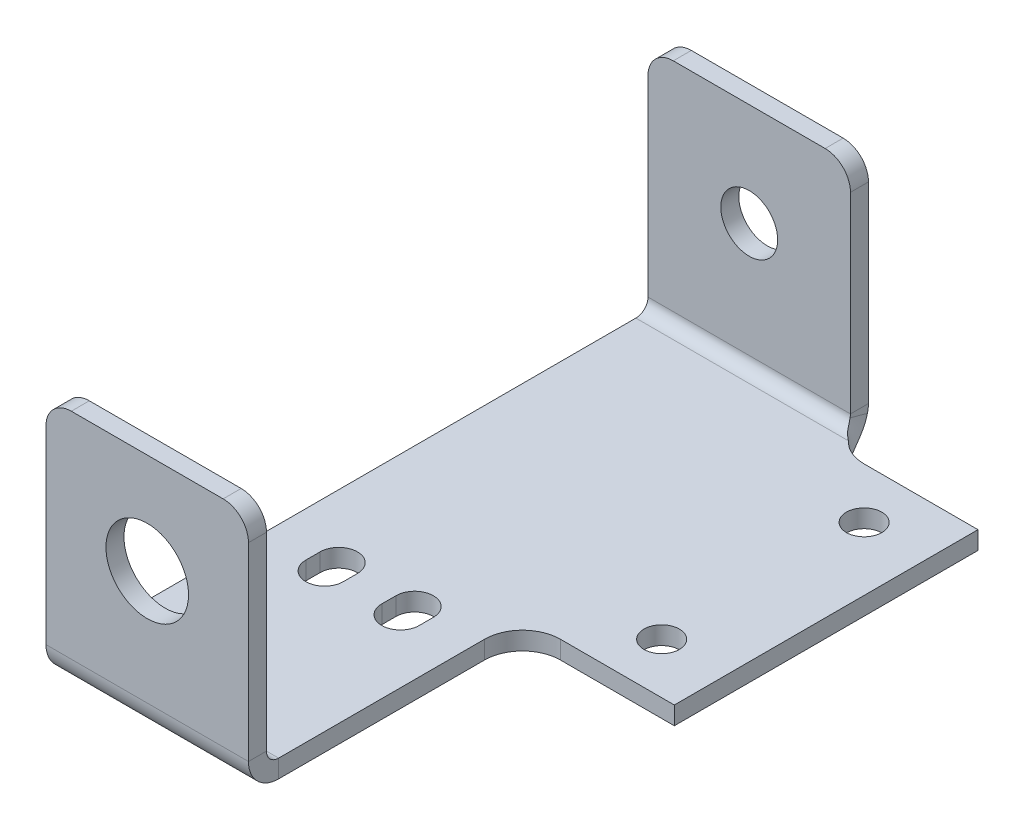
ISO-10303-21;
HEADER;
FILE_DESCRIPTION(('STEP AP214'),'2;1');
FILE_NAME('part.step','',(''),(''),'','','');
FILE_SCHEMA(('AUTOMOTIVE_DESIGN { 1 0 10303 214 1 1 1 1 }'));
ENDSEC;
DATA;
#1=APPLICATION_CONTEXT('core data for automotive mechanical design processes');
#2=APPLICATION_PROTOCOL_DEFINITION('international standard','automotive_design',2000,#1);
#3=PRODUCT_CONTEXT('',#1,'mechanical');
#4=PRODUCT('Part','Part','',(#3));
#5=PRODUCT_RELATED_PRODUCT_CATEGORY('part','',(#4));
#6=PRODUCT_DEFINITION_FORMATION('','',#4);
#7=PRODUCT_DEFINITION_CONTEXT('part definition',#1,'design');
#8=PRODUCT_DEFINITION('design','',#6,#7);
#9=PRODUCT_DEFINITION_SHAPE('','',#8);
#10=(LENGTH_UNIT() NAMED_UNIT(*) SI_UNIT(.MILLI.,.METRE.));
#11=(NAMED_UNIT(*) PLANE_ANGLE_UNIT() SI_UNIT($,.RADIAN.));
#12=(NAMED_UNIT(*) SI_UNIT($,.STERADIAN.) SOLID_ANGLE_UNIT());
#13=UNCERTAINTY_MEASURE_WITH_UNIT(LENGTH_MEASURE(1.E-05),#10,'distance_accuracy_value','');
#14=(GEOMETRIC_REPRESENTATION_CONTEXT(3) GLOBAL_UNCERTAINTY_ASSIGNED_CONTEXT((#13)) GLOBAL_UNIT_ASSIGNED_CONTEXT((#10,
#11,#12)) REPRESENTATION_CONTEXT('',''));
#15=CARTESIAN_POINT('',(0.,0.,0.));
#16=DIRECTION('',(0.,0.,1.));
#17=DIRECTION('',(1.,0.,0.));
#18=AXIS2_PLACEMENT_3D('',#15,#16,#17);
#19=CARTESIAN_POINT('',(-12.7,3.7846,36.63315));
#20=DIRECTION('',(-1.,0.,0.));
#21=DIRECTION('',(0.,0.,1.));
#22=AXIS2_PLACEMENT_3D('',#19,#20,#21);
#23=PLANE('',#22);
#24=DIRECTION('',(0.,0.,-1.));
#25=VECTOR('',#24,1.);
#26=CARTESIAN_POINT('',(-12.7,0.,38.89375));
#27=LINE('',#26,#25);
#28=CARTESIAN_POINT('',(-12.7,0.,35.10915));
#29=VERTEX_POINT('',#28);
#30=CARTESIAN_POINT('',(-12.7,0.,-35.10915));
#31=VERTEX_POINT('',#30);
#32=EDGE_CURVE('E586',#29,#31,#27,.T.);
#33=ORIENTED_EDGE('',*,*,#32,.F.);
#34=DIRECTION('',(0.,1.,0.));
#35=VECTOR('',#34,1.);
#36=CARTESIAN_POINT('',(-12.7,0.,35.10915));
#37=LINE('',#36,#35);
#38=CARTESIAN_POINT('',(-12.7,2.2606,35.10915));
#39=VERTEX_POINT('',#38);
#40=EDGE_CURVE('E608',#29,#39,#37,.T.);
#41=ORIENTED_EDGE('',*,*,#40,.T.);
#42=DIRECTION('',(0.,0.,-1.));
#43=VECTOR('',#42,1.);
#44=CARTESIAN_POINT('',(-12.7,2.2606,38.89375));
#45=LINE('',#44,#43);
#46=CARTESIAN_POINT('',(-12.7,2.26060000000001,-35.10915));
#47=VERTEX_POINT('',#46);
#48=EDGE_CURVE('E579',#39,#47,#45,.T.);
#49=ORIENTED_EDGE('',*,*,#48,.T.);
#50=DIRECTION('',(0.,-1.,0.));
#51=VECTOR('',#50,1.);
#52=CARTESIAN_POINT('',(-12.7,2.26060000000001,-35.10915));
#53=LINE('',#52,#51);
#54=EDGE_CURVE('E12',#47,#31,#53,.T.);
#55=ORIENTED_EDGE('',*,*,#54,.T.);
#56=EDGE_LOOP('',(#33,#41,#49,#55));
#57=FACE_BOUND('',#56,.T.);
#58=ADVANCED_FACE('F46',(#57),#23,.T.);
#59=CARTESIAN_POINT('',(12.7,3.78460000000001,-36.63315));
#60=DIRECTION('',(1.,0.,0.));
#61=DIRECTION('',(0.,0.,-1.));
#62=AXIS2_PLACEMENT_3D('',#59,#60,#61);
#63=PLANE('',#62);
#64=DIRECTION('',(0.,0.,-1.));
#65=VECTOR('',#64,1.);
#66=CARTESIAN_POINT('',(12.7,0.,38.89375));
#67=LINE('',#66,#65);
#68=CARTESIAN_POINT('',(12.7,0.,35.10915));
#69=VERTEX_POINT('',#68);
#70=CARTESIAN_POINT('',(12.7,0.,9.27735));
#71=VERTEX_POINT('',#70);
#72=EDGE_CURVE('E585',#69,#71,#67,.T.);
#73=ORIENTED_EDGE('',*,*,#72,.T.);
#74=DIRECTION('',(0.,1.,0.));
#75=VECTOR('',#74,1.);
#76=CARTESIAN_POINT('',(12.7,2.26060000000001,9.27735));
#77=LINE('',#76,#75);
#78=CARTESIAN_POINT('',(12.7,2.26060000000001,9.27735));
#79=VERTEX_POINT('',#78);
#80=EDGE_CURVE('E589',#71,#79,#77,.T.);
#81=ORIENTED_EDGE('',*,*,#80,.T.);
#82=DIRECTION('',(0.,0.,-1.));
#83=VECTOR('',#82,1.);
#84=CARTESIAN_POINT('',(12.7,2.2606,38.89375));
#85=LINE('',#84,#83);
#86=CARTESIAN_POINT('',(12.7,2.2606,35.10915));
#87=VERTEX_POINT('',#86);
#88=EDGE_CURVE('E582',#87,#79,#85,.T.);
#89=ORIENTED_EDGE('',*,*,#88,.F.);
#90=DIRECTION('',(0.,-1.,0.));
#91=VECTOR('',#90,1.);
#92=CARTESIAN_POINT('',(12.7,2.2606,35.10915));
#93=LINE('',#92,#91);
#94=EDGE_CURVE('E615',#87,#69,#93,.T.);
#95=ORIENTED_EDGE('',*,*,#94,.T.);
#96=EDGE_LOOP('',(#73,#81,#89,#95));
#97=FACE_BOUND('',#96,.T.);
#98=ADVANCED_FACE('F677',(#97),#63,.T.);
#99=CARTESIAN_POINT('',(12.7,2.2606,38.89375));
#100=DIRECTION('',(0.,1.,0.));
#101=DIRECTION('',(0.,0.,1.));
#102=AXIS2_PLACEMENT_3D('',#99,#100,#101);
#103=PLANE('',#102);
#104=CARTESIAN_POINT('',(4.7625,2.2606,11.88085));
#105=DIRECTION('',(0.,1.,0.));
#106=DIRECTION('',(0.,0.,1.));
#107=AXIS2_PLACEMENT_3D('',#104,#105,#106);
#108=CIRCLE('',#107,2.3495);
#109=CARTESIAN_POINT('',(2.413,2.2606,11.88085));
#110=VERTEX_POINT('',#109);
#111=CARTESIAN_POINT('',(7.112,2.2606,11.88085));
#112=VERTEX_POINT('',#111);
#113=EDGE_CURVE('E64',#110,#112,#108,.T.);
#114=ORIENTED_EDGE('',*,*,#113,.F.);
#115=DIRECTION('',(0.,0.,1.));
#116=VECTOR('',#115,1.);
#117=CARTESIAN_POINT('',(2.413,2.2606,11.88085));
#118=LINE('',#117,#116);
#119=CARTESIAN_POINT('',(2.413,2.26060000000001,10.10285));
#120=VERTEX_POINT('',#119);
#121=EDGE_CURVE('E264',#120,#110,#118,.T.);
#122=ORIENTED_EDGE('',*,*,#121,.F.);
#123=CARTESIAN_POINT('',(4.7625,2.26060000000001,10.10285));
#124=DIRECTION('',(0.,1.,0.));
#125=DIRECTION('',(0.,0.,1.));
#126=AXIS2_PLACEMENT_3D('',#123,#124,#125);
#127=CIRCLE('',#126,2.3495);
#128=CARTESIAN_POINT('',(7.112,2.26060000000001,10.10285));
#129=VERTEX_POINT('',#128);
#130=EDGE_CURVE('E267',#129,#120,#127,.T.);
#131=ORIENTED_EDGE('',*,*,#130,.F.);
#132=DIRECTION('',(0.,0.,-1.));
#133=VECTOR('',#132,1.);
#134=CARTESIAN_POINT('',(7.112,2.2606,11.88085));
#135=LINE('',#134,#133);
#136=EDGE_CURVE('E273',#112,#129,#135,.T.);
#137=ORIENTED_EDGE('',*,*,#136,.F.);
#138=EDGE_LOOP('',(#114,#122,#131,#137));
#139=FACE_BOUND('',#138,.T.);
#140=CARTESIAN_POINT('',(-4.7625,2.2606,11.88085));
#141=DIRECTION('',(0.,1.,0.));
#142=DIRECTION('',(0.,0.,1.));
#143=AXIS2_PLACEMENT_3D('',#140,#141,#142);
#144=CIRCLE('',#143,2.3495);
#145=CARTESIAN_POINT('',(-7.112,2.2606,11.88085));
#146=VERTEX_POINT('',#145);
#147=CARTESIAN_POINT('',(-2.413,2.2606,11.88085));
#148=VERTEX_POINT('',#147);
#149=EDGE_CURVE('E279',#146,#148,#144,.T.);
#150=ORIENTED_EDGE('',*,*,#149,.F.);
#151=DIRECTION('',(0.,0.,1.));
#152=VECTOR('',#151,1.);
#153=CARTESIAN_POINT('',(-7.112,2.2606,11.88085));
#154=LINE('',#153,#152);
#155=CARTESIAN_POINT('',(-7.112,2.26060000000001,10.10285));
#156=VERTEX_POINT('',#155);
#157=EDGE_CURVE('E287',#156,#146,#154,.T.);
#158=ORIENTED_EDGE('',*,*,#157,.F.);
#159=CARTESIAN_POINT('',(-4.7625,2.26060000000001,10.10285));
#160=DIRECTION('',(0.,1.,0.));
#161=DIRECTION('',(0.,0.,1.));
#162=AXIS2_PLACEMENT_3D('',#159,#160,#161);
#163=CIRCLE('',#162,2.3495);
#164=CARTESIAN_POINT('',(-2.413,2.26060000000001,10.10285));
#165=VERTEX_POINT('',#164);
#166=EDGE_CURVE('E301',#165,#156,#163,.T.);
#167=ORIENTED_EDGE('',*,*,#166,.F.);
#168=DIRECTION('',(0.,0.,-1.));
#169=VECTOR('',#168,1.);
#170=CARTESIAN_POINT('',(-2.413,2.2606,11.88085));
#171=LINE('',#170,#169);
#172=EDGE_CURVE('E298',#148,#165,#171,.T.);
#173=ORIENTED_EDGE('',*,*,#172,.F.);
#174=EDGE_LOOP('',(#150,#158,#167,#173));
#175=FACE_BOUND('',#174,.T.);
#176=CARTESIAN_POINT('',(23.8125,2.26060000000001,-27.23515));
#177=DIRECTION('',(0.,1.,0.));
#178=DIRECTION('',(0.,0.,1.));
#179=AXIS2_PLACEMENT_3D('',#176,#177,#178);
#180=CIRCLE('',#179,2.2225);
#181=CARTESIAN_POINT('',(23.8125,2.26060000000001,-25.01265));
#182=VERTEX_POINT('',#181);
#183=EDGE_CURVE('E308',#182,#182,#180,.T.);
#184=ORIENTED_EDGE('',*,*,#183,.F.);
#185=EDGE_LOOP('',(#184));
#186=FACE_BOUND('',#185,.T.);
#187=CARTESIAN_POINT('',(23.8125,2.26060000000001,-1.83515));
#188=DIRECTION('',(0.,1.,0.));
#189=DIRECTION('',(0.,0.,1.));
#190=AXIS2_PLACEMENT_3D('',#187,#188,#189);
#191=CIRCLE('',#190,2.2225);
#192=CARTESIAN_POINT('',(23.8125,2.26060000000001,0.387349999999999));
#193=VERTEX_POINT('',#192);
#194=EDGE_CURVE('E318',#193,#193,#191,.T.);
#195=ORIENTED_EDGE('',*,*,#194,.F.);
#196=EDGE_LOOP('',(#195));
#197=FACE_BOUND('',#196,.T.);
#198=ORIENTED_EDGE('',*,*,#48,.F.);
#199=DIRECTION('',(-1.,0.,0.));
#200=VECTOR('',#199,1.);
#201=CARTESIAN_POINT('',(12.7,2.2606,35.10915));
#202=LINE('',#201,#200);
#203=EDGE_CURVE('E606',#87,#39,#202,.T.);
#204=ORIENTED_EDGE('',*,*,#203,.F.);
#205=ORIENTED_EDGE('',*,*,#88,.T.);
#206=CARTESIAN_POINT('',(17.4625,2.26060000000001,9.27735));
#207=DIRECTION('',(0.,1.,0.));
#208=DIRECTION('',(0.,0.,1.));
#209=AXIS2_PLACEMENT_3D('',#206,#207,#208);
#210=CIRCLE('',#209,4.7625);
#211=CARTESIAN_POINT('',(17.4625,2.26060000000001,4.51485));
#212=VERTEX_POINT('',#211);
#213=EDGE_CURVE('E601',#79,#212,#210,.F.);
#214=ORIENTED_EDGE('',*,*,#213,.T.);
#215=DIRECTION('',(1.,0.,0.));
#216=VECTOR('',#215,1.);
#217=CARTESIAN_POINT('',(12.7,2.26060000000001,4.51485));
#218=LINE('',#217,#216);
#219=CARTESIAN_POINT('',(31.75,2.26060000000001,4.51485));
#220=VERTEX_POINT('',#219);
#221=EDGE_CURVE('E557',#212,#220,#218,.T.);
#222=ORIENTED_EDGE('',*,*,#221,.T.);
#223=DIRECTION('',(0.,0.,-1.));
#224=VECTOR('',#223,1.);
#225=CARTESIAN_POINT('',(31.75,2.26060000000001,4.51485));
#226=LINE('',#225,#224);
#227=CARTESIAN_POINT('',(31.75,2.26060000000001,-33.58515));
#228=VERTEX_POINT('',#227);
#229=EDGE_CURVE('E572',#220,#228,#226,.T.);
#230=ORIENTED_EDGE('',*,*,#229,.T.);
#231=DIRECTION('',(-1.,0.,0.));
#232=VECTOR('',#231,1.);
#233=CARTESIAN_POINT('',(12.7,2.26060000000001,-33.58515));
#234=LINE('',#233,#232);
#235=CARTESIAN_POINT('',(17.4625,2.26060000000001,-33.58515));
#236=VERTEX_POINT('',#235);
#237=EDGE_CURVE('E564',#228,#236,#234,.T.);
#238=ORIENTED_EDGE('',*,*,#237,.T.);
#239=CARTESIAN_POINT('',(17.4625,2.26060000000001,-38.34765));
#240=DIRECTION('',(0.,1.,0.));
#241=DIRECTION('',(0.,0.,1.));
#242=AXIS2_PLACEMENT_3D('',#239,#240,#241);
#243=CIRCLE('',#242,4.7625);
#244=CARTESIAN_POINT('',(13.9705773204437,2.26060000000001,-35.10915));
#245=VERTEX_POINT('',#244);
#246=EDGE_CURVE('E605',#236,#245,#243,.F.);
#247=ORIENTED_EDGE('',*,*,#246,.T.);
#248=DIRECTION('',(-1.,0.,0.));
#249=VECTOR('',#248,1.);
#250=CARTESIAN_POINT('',(12.7,2.26060000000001,-35.10915));
#251=LINE('',#250,#249);
#252=EDGE_CURVE('E617',#245,#47,#251,.T.);
#253=ORIENTED_EDGE('',*,*,#252,.T.);
#254=EDGE_LOOP('',(#198,#204,#205,#214,#222,#230,#238,#247,#253));
#255=FACE_BOUND('',#254,.T.);
#256=ADVANCED_FACE('F655',(#139,#175,#186,#197,#255),#103,.T.);
#257=CARTESIAN_POINT('',(12.7,0.,38.89375));
#258=DIRECTION('',(0.,1.,0.));
#259=DIRECTION('',(0.,0.,1.));
#260=AXIS2_PLACEMENT_3D('',#257,#258,#259);
#261=PLANE('',#260);
#262=DIRECTION('',(0.,0.,1.));
#263=VECTOR('',#262,1.);
#264=CARTESIAN_POINT('',(2.413,0.,11.88085));
#265=LINE('',#264,#263);
#266=CARTESIAN_POINT('',(2.413,0.,10.10285));
#267=VERTEX_POINT('',#266);
#268=CARTESIAN_POINT('',(2.413,0.,11.88085));
#269=VERTEX_POINT('',#268);
#270=EDGE_CURVE('E254',#267,#269,#265,.T.);
#271=ORIENTED_EDGE('',*,*,#270,.T.);
#272=CARTESIAN_POINT('',(4.7625,0.,11.88085));
#273=DIRECTION('',(0.,1.,0.));
#274=DIRECTION('',(0.,0.,1.));
#275=AXIS2_PLACEMENT_3D('',#272,#273,#274);
#276=CIRCLE('',#275,2.3495);
#277=CARTESIAN_POINT('',(7.112,0.,11.88085));
#278=VERTEX_POINT('',#277);
#279=EDGE_CURVE('E248',#269,#278,#276,.T.);
#280=ORIENTED_EDGE('',*,*,#279,.T.);
#281=DIRECTION('',(0.,0.,-1.));
#282=VECTOR('',#281,1.);
#283=CARTESIAN_POINT('',(7.112,0.,11.88085));
#284=LINE('',#283,#282);
#285=CARTESIAN_POINT('',(7.112,0.,10.10285));
#286=VERTEX_POINT('',#285);
#287=EDGE_CURVE('E257',#278,#286,#284,.T.);
#288=ORIENTED_EDGE('',*,*,#287,.T.);
#289=CARTESIAN_POINT('',(4.7625,0.,10.10285));
#290=DIRECTION('',(0.,1.,0.));
#291=DIRECTION('',(0.,0.,1.));
#292=AXIS2_PLACEMENT_3D('',#289,#290,#291);
#293=CIRCLE('',#292,2.3495);
#294=EDGE_CURVE('E72',#286,#267,#293,.T.);
#295=ORIENTED_EDGE('',*,*,#294,.T.);
#296=EDGE_LOOP('',(#271,#280,#288,#295));
#297=FACE_BOUND('',#296,.T.);
#298=DIRECTION('',(0.,0.,1.));
#299=VECTOR('',#298,1.);
#300=CARTESIAN_POINT('',(-7.112,0.,11.88085));
#301=LINE('',#300,#299);
#302=CARTESIAN_POINT('',(-7.112,0.,10.10285));
#303=VERTEX_POINT('',#302);
#304=CARTESIAN_POINT('',(-7.112,0.,11.88085));
#305=VERTEX_POINT('',#304);
#306=EDGE_CURVE('E293',#303,#305,#301,.T.);
#307=ORIENTED_EDGE('',*,*,#306,.T.);
#308=CARTESIAN_POINT('',(-4.7625,0.,11.88085));
#309=DIRECTION('',(0.,1.,0.));
#310=DIRECTION('',(0.,0.,1.));
#311=AXIS2_PLACEMENT_3D('',#308,#309,#310);
#312=CIRCLE('',#311,2.3495);
#313=CARTESIAN_POINT('',(-2.413,0.,11.88085));
#314=VERTEX_POINT('',#313);
#315=EDGE_CURVE('E283',#305,#314,#312,.T.);
#316=ORIENTED_EDGE('',*,*,#315,.T.);
#317=DIRECTION('',(0.,0.,-1.));
#318=VECTOR('',#317,1.);
#319=CARTESIAN_POINT('',(-2.413,0.,11.88085));
#320=LINE('',#319,#318);
#321=CARTESIAN_POINT('',(-2.413,0.,10.10285));
#322=VERTEX_POINT('',#321);
#323=EDGE_CURVE('E286',#314,#322,#320,.T.);
#324=ORIENTED_EDGE('',*,*,#323,.T.);
#325=CARTESIAN_POINT('',(-4.7625,0.,10.10285));
#326=DIRECTION('',(0.,1.,0.));
#327=DIRECTION('',(0.,0.,1.));
#328=AXIS2_PLACEMENT_3D('',#325,#326,#327);
#329=CIRCLE('',#328,2.3495);
#330=EDGE_CURVE('E290',#322,#303,#329,.T.);
#331=ORIENTED_EDGE('',*,*,#330,.T.);
#332=EDGE_LOOP('',(#307,#316,#324,#331));
#333=FACE_BOUND('',#332,.T.);
#334=CARTESIAN_POINT('',(23.8125,0.,-27.23515));
#335=DIRECTION('',(0.,1.,0.));
#336=DIRECTION('',(0.,0.,1.));
#337=AXIS2_PLACEMENT_3D('',#334,#335,#336);
#338=CIRCLE('',#337,2.2225);
#339=CARTESIAN_POINT('',(23.8125,0.,-25.01265));
#340=VERTEX_POINT('',#339);
#341=EDGE_CURVE('E315',#340,#340,#338,.T.);
#342=ORIENTED_EDGE('',*,*,#341,.T.);
#343=EDGE_LOOP('',(#342));
#344=FACE_BOUND('',#343,.T.);
#345=CARTESIAN_POINT('',(23.8125,0.,-1.83515));
#346=DIRECTION('',(0.,1.,0.));
#347=DIRECTION('',(0.,0.,1.));
#348=AXIS2_PLACEMENT_3D('',#345,#346,#347);
#349=CIRCLE('',#348,2.2225);
#350=CARTESIAN_POINT('',(23.8125,0.,0.387349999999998));
#351=VERTEX_POINT('',#350);
#352=EDGE_CURVE('E321',#351,#351,#349,.T.);
#353=ORIENTED_EDGE('',*,*,#352,.T.);
#354=EDGE_LOOP('',(#353));
#355=FACE_BOUND('',#354,.T.);
#356=ORIENTED_EDGE('',*,*,#32,.T.);
#357=DIRECTION('',(-1.,0.,0.));
#358=VECTOR('',#357,1.);
#359=CARTESIAN_POINT('',(12.7,0.,-35.10915));
#360=LINE('',#359,#358);
#361=CARTESIAN_POINT('',(13.9705773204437,0.,-35.10915));
#362=VERTEX_POINT('',#361);
#363=EDGE_CURVE('E56',#362,#31,#360,.T.);
#364=ORIENTED_EDGE('',*,*,#363,.F.);
#365=CARTESIAN_POINT('',(17.4625,0.,-38.34765));
#366=DIRECTION('',(0.,1.,0.));
#367=DIRECTION('',(0.,0.,1.));
#368=AXIS2_PLACEMENT_3D('',#365,#366,#367);
#369=CIRCLE('',#368,4.7625);
#370=CARTESIAN_POINT('',(17.4625,0.,-33.58515));
#371=VERTEX_POINT('',#370);
#372=EDGE_CURVE('E609',#362,#371,#369,.T.);
#373=ORIENTED_EDGE('',*,*,#372,.T.);
#374=DIRECTION('',(-1.,0.,0.));
#375=VECTOR('',#374,1.);
#376=CARTESIAN_POINT('',(12.7,0.,-33.58515));
#377=LINE('',#376,#375);
#378=CARTESIAN_POINT('',(31.75,0.,-33.58515));
#379=VERTEX_POINT('',#378);
#380=EDGE_CURVE('E567',#379,#371,#377,.T.);
#381=ORIENTED_EDGE('',*,*,#380,.F.);
#382=DIRECTION('',(0.,0.,-1.));
#383=VECTOR('',#382,1.);
#384=CARTESIAN_POINT('',(31.75,0.,4.51485));
#385=LINE('',#384,#383);
#386=CARTESIAN_POINT('',(31.75,0.,4.51485));
#387=VERTEX_POINT('',#386);
#388=EDGE_CURVE('E563',#387,#379,#385,.T.);
#389=ORIENTED_EDGE('',*,*,#388,.F.);
#390=DIRECTION('',(1.,0.,0.));
#391=VECTOR('',#390,1.);
#392=CARTESIAN_POINT('',(12.7,0.,4.51485));
#393=LINE('',#392,#391);
#394=CARTESIAN_POINT('',(17.4625,0.,4.51485));
#395=VERTEX_POINT('',#394);
#396=EDGE_CURVE('E561',#395,#387,#393,.T.);
#397=ORIENTED_EDGE('',*,*,#396,.F.);
#398=CARTESIAN_POINT('',(17.4625,0.,9.27735));
#399=DIRECTION('',(0.,1.,0.));
#400=DIRECTION('',(0.,0.,1.));
#401=AXIS2_PLACEMENT_3D('',#398,#399,#400);
#402=CIRCLE('',#401,4.7625);
#403=EDGE_CURVE('E603',#395,#71,#402,.T.);
#404=ORIENTED_EDGE('',*,*,#403,.T.);
#405=ORIENTED_EDGE('',*,*,#72,.F.);
#406=DIRECTION('',(-1.,0.,0.));
#407=VECTOR('',#406,1.);
#408=CARTESIAN_POINT('',(12.7,0.,35.10915));
#409=LINE('',#408,#407);
#410=EDGE_CURVE('E612',#69,#29,#409,.T.);
#411=ORIENTED_EDGE('',*,*,#410,.T.);
#412=EDGE_LOOP('',(#356,#364,#373,#381,#389,#397,#404,#405,#411));
#413=FACE_BOUND('',#412,.T.);
#414=ADVANCED_FACE('F261',(#297,#333,#344,#355,#413),#261,.F.);
#415=CARTESIAN_POINT('',(12.7,0.,-33.58515));
#416=DIRECTION('',(0.,0.,-1.));
#417=DIRECTION('',(0.,1.,0.));
#418=AXIS2_PLACEMENT_3D('',#415,#416,#417);
#419=PLANE('',#418);
#420=ORIENTED_EDGE('',*,*,#380,.T.);
#421=DIRECTION('',(0.,1.,0.));
#422=VECTOR('',#421,1.);
#423=CARTESIAN_POINT('',(17.4625,2.26060000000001,-33.58515));
#424=LINE('',#423,#422);
#425=EDGE_CURVE('E598',#371,#236,#424,.T.);
#426=ORIENTED_EDGE('',*,*,#425,.T.);
#427=ORIENTED_EDGE('',*,*,#237,.F.);
#428=DIRECTION('',(0.,1.,0.));
#429=VECTOR('',#428,1.);
#430=CARTESIAN_POINT('',(31.75,0.,-33.58515));
#431=LINE('',#430,#429);
#432=EDGE_CURVE('E577',#379,#228,#431,.T.);
#433=ORIENTED_EDGE('',*,*,#432,.F.);
#434=EDGE_LOOP('',(#420,#426,#427,#433));
#435=FACE_BOUND('',#434,.T.);
#436=ADVANCED_FACE('F660',(#435),#419,.T.);
#437=CARTESIAN_POINT('',(31.75,0.,4.51485));
#438=DIRECTION('',(1.,0.,0.));
#439=DIRECTION('',(0.,0.,-1.));
#440=AXIS2_PLACEMENT_3D('',#437,#438,#439);
#441=PLANE('',#440);
#442=ORIENTED_EDGE('',*,*,#229,.F.);
#443=DIRECTION('',(0.,1.,0.));
#444=VECTOR('',#443,1.);
#445=CARTESIAN_POINT('',(31.75,0.,4.51485));
#446=LINE('',#445,#444);
#447=EDGE_CURVE('E570',#387,#220,#446,.T.);
#448=ORIENTED_EDGE('',*,*,#447,.F.);
#449=ORIENTED_EDGE('',*,*,#388,.T.);
#450=ORIENTED_EDGE('',*,*,#432,.T.);
#451=EDGE_LOOP('',(#442,#448,#449,#450));
#452=FACE_BOUND('',#451,.T.);
#453=ADVANCED_FACE('F668',(#452),#441,.T.);
#454=CARTESIAN_POINT('',(12.7,0.,4.51485));
#455=DIRECTION('',(0.,0.,1.));
#456=DIRECTION('',(0.,-1.,0.));
#457=AXIS2_PLACEMENT_3D('',#454,#455,#456);
#458=PLANE('',#457);
#459=ORIENTED_EDGE('',*,*,#221,.F.);
#460=DIRECTION('',(0.,1.,0.));
#461=VECTOR('',#460,1.);
#462=CARTESIAN_POINT('',(17.4625,0.,4.51485));
#463=LINE('',#462,#461);
#464=EDGE_CURVE('E596',#212,#395,#463,.F.);
#465=ORIENTED_EDGE('',*,*,#464,.T.);
#466=ORIENTED_EDGE('',*,*,#396,.T.);
#467=ORIENTED_EDGE('',*,*,#447,.T.);
#468=EDGE_LOOP('',(#459,#465,#466,#467));
#469=FACE_BOUND('',#468,.T.);
#470=ADVANCED_FACE('F671',(#469),#458,.T.);
#471=CARTESIAN_POINT('',(17.4625,3.78460000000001,9.27735));
#472=DIRECTION('',(0.,-1.,0.));
#473=DIRECTION('',(0.,0.,-1.));
#474=AXIS2_PLACEMENT_3D('',#471,#472,#473);
#475=CYLINDRICAL_SURFACE('',#474,4.7625);
#476=ORIENTED_EDGE('',*,*,#403,.F.);
#477=ORIENTED_EDGE('',*,*,#464,.F.);
#478=ORIENTED_EDGE('',*,*,#213,.F.);
#479=ORIENTED_EDGE('',*,*,#80,.F.);
#480=EDGE_LOOP('',(#476,#477,#478,#479));
#481=FACE_BOUND('',#480,.T.);
#482=ADVANCED_FACE('F674',(#481),#475,.F.);
#483=CARTESIAN_POINT('',(17.4625,0.,-38.34765));
#484=DIRECTION('',(0.,-1.,0.));
#485=DIRECTION('',(0.,0.,-1.));
#486=AXIS2_PLACEMENT_3D('',#483,#484,#485);
#487=CYLINDRICAL_SURFACE('',#486,4.7625);
#488=CARTESIAN_POINT('',(13.9705773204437,2.26060000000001,-35.10915));
#489=CARTESIAN_POINT('',(13.9705773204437,0.,-35.10915));
#490=B_SPLINE_CURVE_WITH_KNOTS('',1,(#488,#489),.UNSPECIFIED.,.F.,.F.,(2,2),(0.,1.),.UNSPECIFIED.);
#491=EDGE_CURVE('E490',#245,#362,#490,.T.);
#492=ORIENTED_EDGE('',*,*,#491,.F.);
#493=ORIENTED_EDGE('',*,*,#246,.F.);
#494=ORIENTED_EDGE('',*,*,#425,.F.);
#495=ORIENTED_EDGE('',*,*,#372,.F.);
#496=EDGE_LOOP('',(#492,#493,#494,#495));
#497=FACE_BOUND('',#496,.T.);
#498=ADVANCED_FACE('F48',(#497),#487,.F.);
#499=CARTESIAN_POINT('',(12.7,3.7846,35.10915));
#500=DIRECTION('',(-1.,0.,0.));
#501=DIRECTION('',(0.,0.,1.));
#502=AXIS2_PLACEMENT_3D('',#499,#500,#501);
#503=PLANE('',#502);
#504=DIRECTION('',(0.,0.,-1.));
#505=VECTOR('',#504,1.);
#506=CARTESIAN_POINT('',(12.7,3.78459999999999,38.89375));
#507=LINE('',#506,#505);
#508=CARTESIAN_POINT('',(12.7,3.78459999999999,38.89375));
#509=VERTEX_POINT('',#508);
#510=CARTESIAN_POINT('',(12.7,3.7846,36.63315));
#511=VERTEX_POINT('',#510);
#512=EDGE_CURVE('E494',#509,#511,#507,.T.);
#513=ORIENTED_EDGE('',*,*,#512,.F.);
#514=CARTESIAN_POINT('',(12.7,3.7846,35.10915));
#515=DIRECTION('',(1.,0.,0.));
#516=DIRECTION('',(0.,0.,-1.));
#517=AXIS2_PLACEMENT_3D('',#514,#515,#516);
#518=CIRCLE('',#517,3.7846);
#519=EDGE_CURVE('E502',#509,#69,#518,.T.);
#520=ORIENTED_EDGE('',*,*,#519,.T.);
#521=ORIENTED_EDGE('',*,*,#94,.F.);
#522=CARTESIAN_POINT('',(12.7,3.7846,35.10915));
#523=DIRECTION('',(1.,0.,0.));
#524=DIRECTION('',(0.,0.,-1.));
#525=AXIS2_PLACEMENT_3D('',#522,#523,#524);
#526=CIRCLE('',#525,1.524);
#527=EDGE_CURVE('E550',#511,#87,#526,.T.);
#528=ORIENTED_EDGE('',*,*,#527,.F.);
#529=EDGE_LOOP('',(#513,#520,#521,#528));
#530=FACE_BOUND('',#529,.T.);
#531=ADVANCED_FACE('F682',(#530),#503,.F.);
#532=CARTESIAN_POINT('',(-12.7,3.7846,35.10915));
#533=DIRECTION('',(1.,0.,0.));
#534=DIRECTION('',(0.,0.,-1.));
#535=AXIS2_PLACEMENT_3D('',#532,#533,#534);
#536=PLANE('',#535);
#537=ORIENTED_EDGE('',*,*,#40,.F.);
#538=CARTESIAN_POINT('',(-12.7,3.7846,35.10915));
#539=DIRECTION('',(1.,0.,0.));
#540=DIRECTION('',(0.,0.,-1.));
#541=AXIS2_PLACEMENT_3D('',#538,#539,#540);
#542=CIRCLE('',#541,3.7846);
#543=CARTESIAN_POINT('',(-12.7,3.78459999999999,38.89375));
#544=VERTEX_POINT('',#543);
#545=EDGE_CURVE('E554',#29,#544,#542,.F.);
#546=ORIENTED_EDGE('',*,*,#545,.T.);
#547=DIRECTION('',(0.,0.,1.));
#548=VECTOR('',#547,1.);
#549=CARTESIAN_POINT('',(-12.7,3.78459999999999,36.63315));
#550=LINE('',#549,#548);
#551=CARTESIAN_POINT('',(-12.7,3.7846,36.63315));
#552=VERTEX_POINT('',#551);
#553=EDGE_CURVE('E516',#552,#544,#550,.T.);
#554=ORIENTED_EDGE('',*,*,#553,.F.);
#555=CARTESIAN_POINT('',(-12.7,3.7846,35.10915));
#556=DIRECTION('',(-1.,0.,0.));
#557=DIRECTION('',(0.,0.,1.));
#558=AXIS2_PLACEMENT_3D('',#555,#556,#557);
#559=CIRCLE('',#558,1.524);
#560=EDGE_CURVE('E553',#39,#552,#559,.T.);
#561=ORIENTED_EDGE('',*,*,#560,.F.);
#562=EDGE_LOOP('',(#537,#546,#554,#561));
#563=FACE_BOUND('',#562,.T.);
#564=ADVANCED_FACE('F698',(#563),#536,.F.);
#565=CARTESIAN_POINT('',(-25.7973654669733,3.7846,35.10915));
#566=DIRECTION('',(1.,0.,0.));
#567=DIRECTION('',(0.,0.,-1.));
#568=AXIS2_PLACEMENT_3D('',#565,#566,#567);
#569=CYLINDRICAL_SURFACE('',#568,1.524);
#570=ORIENTED_EDGE('',*,*,#560,.T.);
#571=DIRECTION('',(-1.,0.,0.));
#572=VECTOR('',#571,1.);
#573=CARTESIAN_POINT('',(12.7,3.78459999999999,36.63315));
#574=LINE('',#573,#572);
#575=EDGE_CURVE('E525',#511,#552,#574,.T.);
#576=ORIENTED_EDGE('',*,*,#575,.F.);
#577=ORIENTED_EDGE('',*,*,#527,.T.);
#578=ORIENTED_EDGE('',*,*,#203,.T.);
#579=EDGE_LOOP('',(#570,#576,#577,#578));
#580=FACE_BOUND('',#579,.T.);
#581=ADVANCED_FACE('F686',(#580),#569,.F.);
#582=CARTESIAN_POINT('',(-25.7973654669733,3.7846,35.10915));
#583=DIRECTION('',(1.,0.,0.));
#584=DIRECTION('',(0.,0.,-1.));
#585=AXIS2_PLACEMENT_3D('',#582,#583,#584);
#586=CYLINDRICAL_SURFACE('',#585,3.7846);
#587=ORIENTED_EDGE('',*,*,#545,.F.);
#588=ORIENTED_EDGE('',*,*,#410,.F.);
#589=ORIENTED_EDGE('',*,*,#519,.F.);
#590=DIRECTION('',(-1.,0.,0.));
#591=VECTOR('',#590,1.);
#592=CARTESIAN_POINT('',(12.7,3.78459999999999,38.89375));
#593=LINE('',#592,#591);
#594=EDGE_CURVE('E547',#509,#544,#593,.T.);
#595=ORIENTED_EDGE('',*,*,#594,.T.);
#596=EDGE_LOOP('',(#587,#588,#589,#595));
#597=FACE_BOUND('',#596,.T.);
#598=ADVANCED_FACE('F702',(#597),#586,.T.);
#599=CARTESIAN_POINT('',(9.525,27.559,38.89375));
#600=DIRECTION('',(0.,0.,-1.));
#601=DIRECTION('',(-1.,0.,0.));
#602=AXIS2_PLACEMENT_3D('',#599,#600,#601);
#603=CYLINDRICAL_SURFACE('',#602,3.175);
#604=CARTESIAN_POINT('',(9.525,27.559,38.89375));
#605=DIRECTION('',(0.,0.,-1.));
#606=DIRECTION('',(-1.,0.,0.));
#607=AXIS2_PLACEMENT_3D('',#604,#605,#606);
#608=CIRCLE('',#607,3.175);
#609=CARTESIAN_POINT('',(12.7,27.559,38.89375));
#610=VERTEX_POINT('',#609);
#611=CARTESIAN_POINT('',(9.525,30.734,38.89375));
#612=VERTEX_POINT('',#611);
#613=EDGE_CURVE('E507',#610,#612,#608,.F.);
#614=ORIENTED_EDGE('',*,*,#613,.F.);
#615=DIRECTION('',(0.,0.,-1.));
#616=VECTOR('',#615,1.);
#617=CARTESIAN_POINT('',(12.7,27.559,35.10915));
#618=LINE('',#617,#616);
#619=CARTESIAN_POINT('',(12.7,27.559,36.63315));
#620=VERTEX_POINT('',#619);
#621=EDGE_CURVE('E505',#620,#610,#618,.F.);
#622=ORIENTED_EDGE('',*,*,#621,.F.);
#623=CARTESIAN_POINT('',(9.525,27.559,36.63315));
#624=DIRECTION('',(0.,0.,-1.));
#625=DIRECTION('',(-1.,0.,0.));
#626=AXIS2_PLACEMENT_3D('',#623,#624,#625);
#627=CIRCLE('',#626,3.175);
#628=CARTESIAN_POINT('',(9.525,30.734,36.63315));
#629=VERTEX_POINT('',#628);
#630=EDGE_CURVE('E529',#629,#620,#627,.T.);
#631=ORIENTED_EDGE('',*,*,#630,.F.);
#632=DIRECTION('',(0.,0.,-1.));
#633=VECTOR('',#632,1.);
#634=CARTESIAN_POINT('',(9.525,30.734,38.89375));
#635=LINE('',#634,#633);
#636=EDGE_CURVE('E539',#612,#629,#635,.T.);
#637=ORIENTED_EDGE('',*,*,#636,.F.);
#638=EDGE_LOOP('',(#614,#622,#631,#637));
#639=FACE_BOUND('',#638,.T.);
#640=ADVANCED_FACE('F710',(#639),#603,.T.);
#641=CARTESIAN_POINT('',(12.7,30.734,38.89375));
#642=DIRECTION('',(0.,1.,0.));
#643=DIRECTION('',(0.,0.,1.));
#644=AXIS2_PLACEMENT_3D('',#641,#642,#643);
#645=PLANE('',#644);
#646=DIRECTION('',(-1.,0.,0.));
#647=VECTOR('',#646,1.);
#648=CARTESIAN_POINT('',(12.7,30.734,36.63315));
#649=LINE('',#648,#647);
#650=CARTESIAN_POINT('',(-9.525,30.734,36.63315));
#651=VERTEX_POINT('',#650);
#652=EDGE_CURVE('E544',#629,#651,#649,.T.);
#653=ORIENTED_EDGE('',*,*,#652,.T.);
#654=DIRECTION('',(0.,0.,-1.));
#655=VECTOR('',#654,1.);
#656=CARTESIAN_POINT('',(-9.525,30.734,38.89375));
#657=LINE('',#656,#655);
#658=CARTESIAN_POINT('',(-9.525,30.734,38.89375));
#659=VERTEX_POINT('',#658);
#660=EDGE_CURVE('E542',#651,#659,#657,.F.);
#661=ORIENTED_EDGE('',*,*,#660,.T.);
#662=DIRECTION('',(-1.,0.,0.));
#663=VECTOR('',#662,1.);
#664=CARTESIAN_POINT('',(12.7,30.734,38.89375));
#665=LINE('',#664,#663);
#666=EDGE_CURVE('E513',#612,#659,#665,.T.);
#667=ORIENTED_EDGE('',*,*,#666,.F.);
#668=ORIENTED_EDGE('',*,*,#636,.T.);
#669=EDGE_LOOP('',(#653,#661,#667,#668));
#670=FACE_BOUND('',#669,.T.);
#671=ADVANCED_FACE('F715',(#670),#645,.T.);
#672=CARTESIAN_POINT('',(-9.525,27.559,-35.10915));
#673=DIRECTION('',(0.,0.,1.));
#674=DIRECTION('',(1.,0.,0.));
#675=AXIS2_PLACEMENT_3D('',#672,#673,#674);
#676=CYLINDRICAL_SURFACE('',#675,3.175);
#677=CARTESIAN_POINT('',(-9.525,27.559,38.89375));
#678=DIRECTION('',(0.,0.,-1.));
#679=DIRECTION('',(-1.,0.,0.));
#680=AXIS2_PLACEMENT_3D('',#677,#678,#679);
#681=CIRCLE('',#680,3.175);
#682=CARTESIAN_POINT('',(-12.7,27.559,38.89375));
#683=VERTEX_POINT('',#682);
#684=EDGE_CURVE('E511',#659,#683,#681,.F.);
#685=ORIENTED_EDGE('',*,*,#684,.F.);
#686=ORIENTED_EDGE('',*,*,#660,.F.);
#687=CARTESIAN_POINT('',(-9.525,27.559,36.63315));
#688=DIRECTION('',(0.,0.,-1.));
#689=DIRECTION('',(-1.,0.,0.));
#690=AXIS2_PLACEMENT_3D('',#687,#688,#689);
#691=CIRCLE('',#690,3.175);
#692=CARTESIAN_POINT('',(-12.7,27.559,36.63315));
#693=VERTEX_POINT('',#692);
#694=EDGE_CURVE('E531',#693,#651,#691,.T.);
#695=ORIENTED_EDGE('',*,*,#694,.F.);
#696=DIRECTION('',(0.,0.,-1.));
#697=VECTOR('',#696,1.);
#698=CARTESIAN_POINT('',(-12.7,27.559,36.63315));
#699=LINE('',#698,#697);
#700=EDGE_CURVE('E522',#683,#693,#699,.T.);
#701=ORIENTED_EDGE('',*,*,#700,.F.);
#702=EDGE_LOOP('',(#685,#686,#695,#701));
#703=FACE_BOUND('',#702,.T.);
#704=ADVANCED_FACE('F719',(#703),#676,.T.);
#705=CARTESIAN_POINT('',(0.,18.1356,36.63315));
#706=DIRECTION('',(0.,0.,1.));
#707=DIRECTION('',(1.,0.,0.));
#708=AXIS2_PLACEMENT_3D('',#705,#706,#707);
#709=CYLINDRICAL_SURFACE('',#708,5.1816);
#710=CARTESIAN_POINT('',(0.,18.1356,36.63315));
#711=DIRECTION('',(0.,0.,1.));
#712=DIRECTION('',(1.,0.,0.));
#713=AXIS2_PLACEMENT_3D('',#710,#711,#712);
#714=CIRCLE('',#713,5.1816);
#715=CARTESIAN_POINT('',(5.1816,18.1356,36.63315));
#716=VERTEX_POINT('',#715);
#717=EDGE_CURVE('E533',#716,#716,#714,.T.);
#718=ORIENTED_EDGE('',*,*,#717,.F.);
#719=EDGE_LOOP('',(#718));
#720=FACE_BOUND('',#719,.T.);
#721=CARTESIAN_POINT('',(0.,18.1356,38.89375));
#722=DIRECTION('',(0.,0.,1.));
#723=DIRECTION('',(1.,0.,0.));
#724=AXIS2_PLACEMENT_3D('',#721,#722,#723);
#725=CIRCLE('',#724,5.1816);
#726=CARTESIAN_POINT('',(5.1816,18.1356,38.89375));
#727=VERTEX_POINT('',#726);
#728=EDGE_CURVE('E536',#727,#727,#725,.T.);
#729=ORIENTED_EDGE('',*,*,#728,.T.);
#730=EDGE_LOOP('',(#729));
#731=FACE_BOUND('',#730,.T.);
#732=ADVANCED_FACE('F721',(#720,#731),#709,.F.);
#733=CARTESIAN_POINT('',(12.7,0.,36.63315));
#734=DIRECTION('',(0.,0.,-1.));
#735=DIRECTION('',(-1.,0.,0.));
#736=AXIS2_PLACEMENT_3D('',#733,#734,#735);
#737=PLANE('',#736);
#738=ORIENTED_EDGE('',*,*,#717,.T.);
#739=EDGE_LOOP('',(#738));
#740=FACE_BOUND('',#739,.T.);
#741=DIRECTION('',(0.,1.,0.));
#742=VECTOR('',#741,1.);
#743=CARTESIAN_POINT('',(-12.7,0.,36.63315));
#744=LINE('',#743,#742);
#745=EDGE_CURVE('E519',#693,#552,#744,.F.);
#746=ORIENTED_EDGE('',*,*,#745,.F.);
#747=ORIENTED_EDGE('',*,*,#694,.T.);
#748=ORIENTED_EDGE('',*,*,#652,.F.);
#749=ORIENTED_EDGE('',*,*,#630,.T.);
#750=DIRECTION('',(0.,1.,0.));
#751=VECTOR('',#750,1.);
#752=CARTESIAN_POINT('',(12.7,0.,36.63315));
#753=LINE('',#752,#751);
#754=EDGE_CURVE('E527',#620,#511,#753,.F.);
#755=ORIENTED_EDGE('',*,*,#754,.T.);
#756=ORIENTED_EDGE('',*,*,#575,.T.);
#757=EDGE_LOOP('',(#746,#747,#748,#749,#755,#756));
#758=FACE_BOUND('',#757,.T.);
#759=ADVANCED_FACE('F690',(#740,#758),#737,.T.);
#760=CARTESIAN_POINT('',(-12.7,3.78460000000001,-35.10915));
#761=DIRECTION('',(1.,0.,0.));
#762=DIRECTION('',(0.,0.,-1.));
#763=AXIS2_PLACEMENT_3D('',#760,#761,#762);
#764=PLANE('',#763);
#765=DIRECTION('',(0.,-1.,0.));
#766=VECTOR('',#765,1.);
#767=CARTESIAN_POINT('',(-12.7,0.,38.89375));
#768=LINE('',#767,#766);
#769=EDGE_CURVE('E509',#683,#544,#768,.T.);
#770=ORIENTED_EDGE('',*,*,#769,.F.);
#771=ORIENTED_EDGE('',*,*,#700,.T.);
#772=ORIENTED_EDGE('',*,*,#745,.T.);
#773=ORIENTED_EDGE('',*,*,#553,.T.);
#774=EDGE_LOOP('',(#770,#771,#772,#773));
#775=FACE_BOUND('',#774,.T.);
#776=ADVANCED_FACE('F695',(#775),#764,.F.);
#777=CARTESIAN_POINT('',(12.7,0.,38.89375));
#778=DIRECTION('',(0.,0.,-1.));
#779=DIRECTION('',(-1.,0.,0.));
#780=AXIS2_PLACEMENT_3D('',#777,#778,#779);
#781=PLANE('',#780);
#782=ORIENTED_EDGE('',*,*,#728,.F.);
#783=EDGE_LOOP('',(#782));
#784=FACE_BOUND('',#783,.T.);
#785=ORIENTED_EDGE('',*,*,#666,.T.);
#786=ORIENTED_EDGE('',*,*,#684,.T.);
#787=ORIENTED_EDGE('',*,*,#769,.T.);
#788=ORIENTED_EDGE('',*,*,#594,.F.);
#789=DIRECTION('',(0.,-1.,0.));
#790=VECTOR('',#789,1.);
#791=CARTESIAN_POINT('',(12.7,0.,38.89375));
#792=LINE('',#791,#790);
#793=EDGE_CURVE('E503',#610,#509,#792,.T.);
#794=ORIENTED_EDGE('',*,*,#793,.F.);
#795=ORIENTED_EDGE('',*,*,#613,.T.);
#796=EDGE_LOOP('',(#785,#786,#787,#788,#794,#795));
#797=FACE_BOUND('',#796,.T.);
#798=ADVANCED_FACE('F705',(#784,#797),#781,.F.);
#799=CARTESIAN_POINT('',(12.7,2.26059999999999,35.10915));
#800=DIRECTION('',(1.,0.,0.));
#801=DIRECTION('',(0.,0.,-1.));
#802=AXIS2_PLACEMENT_3D('',#799,#800,#801);
#803=PLANE('',#802);
#804=ORIENTED_EDGE('',*,*,#754,.F.);
#805=ORIENTED_EDGE('',*,*,#621,.T.);
#806=ORIENTED_EDGE('',*,*,#793,.T.);
#807=ORIENTED_EDGE('',*,*,#512,.T.);
#808=EDGE_LOOP('',(#804,#805,#806,#807));
#809=FACE_BOUND('',#808,.T.);
#810=ADVANCED_FACE('F454',(#809),#803,.T.);
#811=CARTESIAN_POINT('',(13.9705773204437,0.,-35.10915));
#812=CARTESIAN_POINT('',(13.7527742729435,0.,-35.5261366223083));
#813=CARTESIAN_POINT('',(13.5701514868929,0.0685494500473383,-35.9055096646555));
#814=CARTESIAN_POINT('',(13.3478918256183,0.223309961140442,-36.401595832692));
#815=CARTESIAN_POINT('',(13.2824785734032,0.283601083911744,-36.554987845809));
#816=CARTESIAN_POINT('',(13.1973686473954,0.381549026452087,-36.7670106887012));
#817=CARTESIAN_POINT('',(13.1711669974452,0.4154578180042,-36.8346864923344));
#818=CARTESIAN_POINT('',(13.1351170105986,0.46759031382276,-36.9317836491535));
#819=CARTESIAN_POINT('',(13.1236424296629,0.485179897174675,-36.9634138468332));
#820=CARTESIAN_POINT('',(13.107243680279,0.511809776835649,-37.0097706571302));
#821=CARTESIAN_POINT('',(13.1019129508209,0.520727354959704,-37.025041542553));
#822=CARTESIAN_POINT('',(13.0941201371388,0.534156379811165,-37.0476778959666));
#823=CARTESIAN_POINT('',(13.0915564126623,0.538641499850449,-37.0551783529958));
#824=CARTESIAN_POINT('',(13.0877616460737,0.545381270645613,-37.066361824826));
#825=CARTESIAN_POINT('',(13.0865051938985,0.547629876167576,-37.0700784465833));
#826=CARTESIAN_POINT('',(13.0840092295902,0.552130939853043,-37.0774893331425));
#827=CARTESIAN_POINT('',(13.083221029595,0.553556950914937,-37.0798333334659));
#828=CARTESIAN_POINT('',(12.9738680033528,0.753805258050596,-37.4070027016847));
#829=CARTESIAN_POINT('',(12.8882377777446,1.02620598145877,-37.7436739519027));
#830=CARTESIAN_POINT('',(12.7610582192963,1.76393492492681,-38.3443264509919));
#831=CARTESIAN_POINT('',(12.7195634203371,2.22964208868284,-38.6071797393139));
#832=CARTESIAN_POINT('',(12.7,2.78443800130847,-38.7592011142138));
#833=CARTESIAN_POINT('',(13.9705773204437,2.26060000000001,-35.10915));
#834=CARTESIAN_POINT('',(13.7529022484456,2.26060000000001,-35.2769654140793));
#835=CARTESIAN_POINT('',(13.5701514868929,2.2882038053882,-35.4298317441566));
#836=CARTESIAN_POINT('',(13.3478918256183,2.35052347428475,-35.6295979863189));
#837=CARTESIAN_POINT('',(13.2824785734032,2.37480177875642,-35.691366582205));
#838=CARTESIAN_POINT('',(13.1973686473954,2.4142439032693,-35.7767449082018));
#839=CARTESIAN_POINT('',(13.1711669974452,2.42789845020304,-35.8039969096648));
#840=CARTESIAN_POINT('',(13.1351170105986,2.44889140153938,-35.8430964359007));
#841=CARTESIAN_POINT('',(13.1236424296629,2.45597445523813,-35.855833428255));
#842=CARTESIAN_POINT('',(13.107243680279,2.46669789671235,-35.8745006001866));
#843=CARTESIAN_POINT('',(13.1019129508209,2.47028886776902,-35.8806499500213));
#844=CARTESIAN_POINT('',(13.0941201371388,2.47569652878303,-35.8897652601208));
#845=CARTESIAN_POINT('',(13.0915564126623,2.47750261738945,-35.8927855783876));
#846=CARTESIAN_POINT('',(13.0877616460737,2.48021661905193,-35.8972889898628));
#847=CARTESIAN_POINT('',(13.0865051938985,2.48112209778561,-35.8987856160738));
#848=CARTESIAN_POINT('',(13.0840092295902,2.48293460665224,-35.901769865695));
#849=CARTESIAN_POINT('',(13.083221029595,2.48350883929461,-35.9027137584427));
#850=CARTESIAN_POINT('',(12.9738680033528,2.56414574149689,-36.0344598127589));
#851=CARTESIAN_POINT('',(12.8882377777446,2.67383730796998,-36.170032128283));
#852=CARTESIAN_POINT('',(12.7610582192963,2.97090936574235,-36.4119056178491));
#853=CARTESIAN_POINT('',(12.7195630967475,3.15844614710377,-36.5177535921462));
#854=CARTESIAN_POINT('',(12.7,3.38185020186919,-36.578969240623));
#855=B_SPLINE_SURFACE_WITH_KNOTS('',1,3,((#811,#812,#813,#814,#815,#816,#817,#818,#819,#820,
#821,#822,#823,#824,#825,#826,#827,#828,#829,#830,#831,#832),(#833,#834,#835,#836,#837,#838,
#839,#840,#841,#842,#843,#844,#845,#846,#847,#848,#849,#850,#851,#852,#853,#854)),.UNSPECIFIED.,
.F.,.F.,.F.,(2,2),(4,2,2,2,2,2,2,2,2,2,4),(0.,1.),(0.,0.25,0.375,0.4375,0.46875,0.484375,
0.4921875,0.49609375,0.5,0.75,1.),.UNSPECIFIED.);
#856=CARTESIAN_POINT('',(13.9705773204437,0.,-35.10915));
#857=CARTESIAN_POINT('',(13.7527742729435,0.,-35.5261366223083));
#858=CARTESIAN_POINT('',(13.5701514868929,0.0685494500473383,-35.9055096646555));
#859=CARTESIAN_POINT('',(13.3478918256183,0.223309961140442,-36.401595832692));
#860=CARTESIAN_POINT('',(13.2824785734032,0.283601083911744,-36.554987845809));
#861=CARTESIAN_POINT('',(13.1973686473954,0.381549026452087,-36.7670106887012));
#862=CARTESIAN_POINT('',(13.1711669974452,0.4154578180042,-36.8346864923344));
#863=CARTESIAN_POINT('',(13.1351170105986,0.46759031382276,-36.9317836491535));
#864=CARTESIAN_POINT('',(13.1236424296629,0.485179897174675,-36.9634138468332));
#865=CARTESIAN_POINT('',(13.107243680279,0.511809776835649,-37.0097706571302));
#866=CARTESIAN_POINT('',(13.1019129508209,0.520727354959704,-37.025041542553));
#867=CARTESIAN_POINT('',(13.0941201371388,0.534156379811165,-37.0476778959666));
#868=CARTESIAN_POINT('',(13.0915564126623,0.538641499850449,-37.0551783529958));
#869=CARTESIAN_POINT('',(13.0877616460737,0.545381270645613,-37.066361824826));
#870=CARTESIAN_POINT('',(13.0865051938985,0.547629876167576,-37.0700784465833));
#871=CARTESIAN_POINT('',(13.0840092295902,0.552130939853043,-37.0774893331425));
#872=CARTESIAN_POINT('',(13.083221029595,0.553556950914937,-37.0798333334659));
#873=CARTESIAN_POINT('',(12.9738680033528,0.753805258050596,-37.4070027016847));
#874=CARTESIAN_POINT('',(12.8882377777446,1.02620598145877,-37.7436739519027));
#875=CARTESIAN_POINT('',(12.7610582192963,1.76393492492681,-38.3443264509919));
#876=CARTESIAN_POINT('',(12.7195634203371,2.22964208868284,-38.6071797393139));
#877=CARTESIAN_POINT('',(12.7,2.78443800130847,-38.7592011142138));
#878=B_SPLINE_CURVE_WITH_KNOTS('',3,(#856,#857,#858,#859,#860,#861,#862,#863,#864,#865,#866,
#867,#868,#869,#870,#871,#872,#873,#874,#875,#876,#877),.UNSPECIFIED.,.F.,.F.,(4,2,2,2,2,2,2,2,
2,2,4),(0.,0.25,0.375,0.4375,0.46875,0.484375,0.4921875,0.49609375,0.5,0.75,1.),.UNSPECIFIED.);
#879=CARTESIAN_POINT('',(12.7,2.78443800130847,-38.7592011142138));
#880=VERTEX_POINT('',#879);
#881=EDGE_CURVE('E329',#362,#880,#878,.T.);
#882=CARTESIAN_POINT('',(12.7,2.78443800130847,-38.7592011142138));
#883=CARTESIAN_POINT('',(12.7,3.38185020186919,-36.578969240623));
#884=B_SPLINE_CURVE_WITH_KNOTS('',1,(#882,#883),.UNSPECIFIED.,.F.,.F.,(2,2),(0.,1.),.UNSPECIFIED.);
#885=CARTESIAN_POINT('',(12.7,3.38185020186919,-36.578969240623));
#886=VERTEX_POINT('',#885);
#887=EDGE_CURVE('E383',#880,#886,#884,.T.);
#888=CARTESIAN_POINT('',(12.7,3.38185020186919,-36.578969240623));
#889=CARTESIAN_POINT('',(12.7195630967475,3.15844614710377,-36.5177535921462));
#890=CARTESIAN_POINT('',(12.7610582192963,2.97090936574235,-36.4119056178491));
#891=CARTESIAN_POINT('',(12.8882377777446,2.67383730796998,-36.170032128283));
#892=CARTESIAN_POINT('',(12.9738680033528,2.56414574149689,-36.0344598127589));
#893=CARTESIAN_POINT('',(13.083221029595,2.48350883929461,-35.9027137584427));
#894=CARTESIAN_POINT('',(13.0840092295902,2.48293460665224,-35.901769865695));
#895=CARTESIAN_POINT('',(13.0865051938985,2.48112209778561,-35.8987856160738));
#896=CARTESIAN_POINT('',(13.0877616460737,2.48021661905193,-35.8972889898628));
#897=CARTESIAN_POINT('',(13.0915564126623,2.47750261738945,-35.8927855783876));
#898=CARTESIAN_POINT('',(13.0941201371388,2.47569652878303,-35.8897652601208));
#899=CARTESIAN_POINT('',(13.1019129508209,2.47028886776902,-35.8806499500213));
#900=CARTESIAN_POINT('',(13.107243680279,2.46669789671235,-35.8745006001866));
#901=CARTESIAN_POINT('',(13.1236424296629,2.45597445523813,-35.855833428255));
#902=CARTESIAN_POINT('',(13.1351170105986,2.44889140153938,-35.8430964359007));
#903=CARTESIAN_POINT('',(13.1711669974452,2.42789845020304,-35.8039969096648));
#904=CARTESIAN_POINT('',(13.1973686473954,2.4142439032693,-35.7767449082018));
#905=CARTESIAN_POINT('',(13.2824785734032,2.37480177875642,-35.691366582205));
#906=CARTESIAN_POINT('',(13.3478918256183,2.35052347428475,-35.6295979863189));
#907=CARTESIAN_POINT('',(13.5701514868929,2.2882038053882,-35.4298317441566));
#908=CARTESIAN_POINT('',(13.7529022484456,2.26060000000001,-35.2769654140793));
#909=CARTESIAN_POINT('',(13.9705773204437,2.26060000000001,-35.10915));
#910=B_SPLINE_CURVE_WITH_KNOTS('',3,(#888,#889,#890,#891,#892,#893,#894,#895,#896,#897,#898,
#899,#900,#901,#902,#903,#904,#905,#906,#907,#908,#909),.UNSPECIFIED.,.F.,.F.,(4,2,2,2,2,2,2,2,
2,2,4),(0.,0.25,0.5,0.50390625,0.5078125,0.515625,0.53125,0.5625,0.625,0.75,1.),.UNSPECIFIED.);
#911=EDGE_CURVE('E387',#245,#886,#910,.F.);
#912=ORIENTED_EDGE('',*,*,#491,.T.);
#913=ORIENTED_EDGE('',*,*,#881,.T.);
#914=ORIENTED_EDGE('',*,*,#887,.T.);
#915=ORIENTED_EDGE('',*,*,#911,.F.);
#916=EDGE_LOOP('',(#912,#913,#914,#915));
#917=FACE_BOUND('',#916,.T.);
#918=ADVANCED_FACE('F443',(#917),#855,.F.);
#919=CARTESIAN_POINT('',(12.7,3.78460000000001,-35.10915));
#920=DIRECTION('',(-1.,0.,0.));
#921=DIRECTION('',(0.,0.,1.));
#922=AXIS2_PLACEMENT_3D('',#919,#920,#921);
#923=PLANE('',#922);
#924=ORIENTED_EDGE('',*,*,#887,.F.);
#925=CARTESIAN_POINT('',(12.7,3.78460000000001,-35.10915));
#926=DIRECTION('',(-1.,0.,0.));
#927=DIRECTION('',(0.,0.,1.));
#928=AXIS2_PLACEMENT_3D('',#925,#926,#927);
#929=CIRCLE('',#928,3.7846);
#930=CARTESIAN_POINT('',(12.7,3.78460000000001,-38.89375));
#931=VERTEX_POINT('',#930);
#932=EDGE_CURVE('E388',#880,#931,#929,.F.);
#933=ORIENTED_EDGE('',*,*,#932,.T.);
#934=DIRECTION('',(0.,0.,-1.));
#935=VECTOR('',#934,1.);
#936=CARTESIAN_POINT('',(12.7,3.78460000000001,-36.63315));
#937=LINE('',#936,#935);
#938=CARTESIAN_POINT('',(12.7,3.78460000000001,-36.63315));
#939=VERTEX_POINT('',#938);
#940=EDGE_CURVE('E346',#939,#931,#937,.T.);
#941=ORIENTED_EDGE('',*,*,#940,.F.);
#942=CARTESIAN_POINT('',(12.7,3.78460000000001,-35.10915));
#943=DIRECTION('',(1.,0.,0.));
#944=DIRECTION('',(0.,0.,-1.));
#945=AXIS2_PLACEMENT_3D('',#942,#943,#944);
#946=CIRCLE('',#945,1.524);
#947=EDGE_CURVE('E384',#886,#939,#946,.T.);
#948=ORIENTED_EDGE('',*,*,#947,.F.);
#949=EDGE_LOOP('',(#924,#933,#941,#948));
#950=FACE_BOUND('',#949,.T.);
#951=ADVANCED_FACE('F419',(#950),#923,.F.);
#952=CARTESIAN_POINT('',(-12.7,3.78460000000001,-35.10915));
#953=DIRECTION('',(1.,0.,0.));
#954=DIRECTION('',(0.,0.,-1.));
#955=AXIS2_PLACEMENT_3D('',#952,#953,#954);
#956=PLANE('',#955);
#957=CARTESIAN_POINT('',(-12.7,3.78460000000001,-35.10915));
#958=DIRECTION('',(-1.,0.,0.));
#959=DIRECTION('',(0.,0.,1.));
#960=AXIS2_PLACEMENT_3D('',#957,#958,#959);
#961=CIRCLE('',#960,3.7846);
#962=CARTESIAN_POINT('',(-12.7,3.78460000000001,-38.89375));
#963=VERTEX_POINT('',#962);
#964=EDGE_CURVE('E385',#963,#31,#961,.T.);
#965=ORIENTED_EDGE('',*,*,#964,.T.);
#966=ORIENTED_EDGE('',*,*,#54,.F.);
#967=CARTESIAN_POINT('',(-12.7,3.78460000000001,-35.10915));
#968=DIRECTION('',(-1.,0.,0.));
#969=DIRECTION('',(0.,0.,1.));
#970=AXIS2_PLACEMENT_3D('',#967,#968,#969);
#971=CIRCLE('',#970,1.524);
#972=CARTESIAN_POINT('',(-12.7,3.78460000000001,-36.63315));
#973=VERTEX_POINT('',#972);
#974=EDGE_CURVE('E380',#973,#47,#971,.T.);
#975=ORIENTED_EDGE('',*,*,#974,.F.);
#976=DIRECTION('',(0.,0.,1.));
#977=VECTOR('',#976,1.);
#978=CARTESIAN_POINT('',(-12.7,3.78460000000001,-38.89375));
#979=LINE('',#978,#977);
#980=EDGE_CURVE('E327',#963,#973,#979,.T.);
#981=ORIENTED_EDGE('',*,*,#980,.F.);
#982=EDGE_LOOP('',(#965,#966,#975,#981));
#983=FACE_BOUND('',#982,.T.);
#984=ADVANCED_FACE('F410',(#983),#956,.F.);
#985=CARTESIAN_POINT('',(27.6845725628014,3.78460000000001,-35.10915));
#986=DIRECTION('',(-1.,0.,0.));
#987=DIRECTION('',(0.,0.,1.));
#988=AXIS2_PLACEMENT_3D('',#985,#986,#987);
#989=CYLINDRICAL_SURFACE('',#988,1.524);
#990=DIRECTION('',(-1.,0.,0.));
#991=VECTOR('',#990,1.);
#992=CARTESIAN_POINT('',(12.7,3.78460000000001,-36.63315));
#993=LINE('',#992,#991);
#994=EDGE_CURVE('E324',#939,#973,#993,.T.);
#995=ORIENTED_EDGE('',*,*,#994,.T.);
#996=ORIENTED_EDGE('',*,*,#974,.T.);
#997=ORIENTED_EDGE('',*,*,#252,.F.);
#998=ORIENTED_EDGE('',*,*,#911,.T.);
#999=ORIENTED_EDGE('',*,*,#947,.T.);
#1000=EDGE_LOOP('',(#995,#996,#997,#998,#999));
#1001=FACE_BOUND('',#1000,.T.);
#1002=ADVANCED_FACE('F399',(#1001),#989,.F.);
#1003=CARTESIAN_POINT('',(27.6845725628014,3.78460000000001,-35.10915));
#1004=DIRECTION('',(-1.,0.,0.));
#1005=DIRECTION('',(0.,0.,1.));
#1006=AXIS2_PLACEMENT_3D('',#1003,#1004,#1005);
#1007=CYLINDRICAL_SURFACE('',#1006,3.7846);
#1008=DIRECTION('',(-1.,0.,0.));
#1009=VECTOR('',#1008,1.);
#1010=CARTESIAN_POINT('',(12.7,3.78460000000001,-38.89375));
#1011=LINE('',#1010,#1009);
#1012=EDGE_CURVE('E341',#931,#963,#1011,.T.);
#1013=ORIENTED_EDGE('',*,*,#1012,.F.);
#1014=ORIENTED_EDGE('',*,*,#932,.F.);
#1015=ORIENTED_EDGE('',*,*,#881,.F.);
#1016=ORIENTED_EDGE('',*,*,#363,.T.);
#1017=ORIENTED_EDGE('',*,*,#964,.F.);
#1018=EDGE_LOOP('',(#1013,#1014,#1015,#1016,#1017));
#1019=FACE_BOUND('',#1018,.T.);
#1020=ADVANCED_FACE('F409',(#1019),#1007,.T.);
#1021=CARTESIAN_POINT('',(-9.525,27.8638,-35.10915));
#1022=DIRECTION('',(0.,0.,-1.));
#1023=DIRECTION('',(-1.,0.,0.));
#1024=AXIS2_PLACEMENT_3D('',#1021,#1022,#1023);
#1025=CYLINDRICAL_SURFACE('',#1024,3.175);
#1026=CARTESIAN_POINT('',(-9.525,27.8638,-36.63315));
#1027=DIRECTION('',(0.,0.,1.));
#1028=DIRECTION('',(0.,-1.,0.));
#1029=AXIS2_PLACEMENT_3D('',#1026,#1027,#1028);
#1030=CIRCLE('',#1029,3.175);
#1031=CARTESIAN_POINT('',(-9.525,31.0388,-36.63315));
#1032=VERTEX_POINT('',#1031);
#1033=CARTESIAN_POINT('',(-12.7,27.8638,-36.63315));
#1034=VERTEX_POINT('',#1033);
#1035=EDGE_CURVE('E354',#1032,#1034,#1030,.T.);
#1036=ORIENTED_EDGE('',*,*,#1035,.F.);
#1037=DIRECTION('',(0.,0.,-1.));
#1038=VECTOR('',#1037,1.);
#1039=CARTESIAN_POINT('',(-9.525,31.0388,-36.63315));
#1040=LINE('',#1039,#1038);
#1041=CARTESIAN_POINT('',(-9.525,31.0388,-38.89375));
#1042=VERTEX_POINT('',#1041);
#1043=EDGE_CURVE('E370',#1042,#1032,#1040,.F.);
#1044=ORIENTED_EDGE('',*,*,#1043,.F.);
#1045=CARTESIAN_POINT('',(-9.525,27.8638,-38.89375));
#1046=DIRECTION('',(0.,0.,1.));
#1047=DIRECTION('',(0.,-1.,0.));
#1048=AXIS2_PLACEMENT_3D('',#1045,#1046,#1047);
#1049=CIRCLE('',#1048,3.175);
#1050=CARTESIAN_POINT('',(-12.7,27.8638,-38.89375));
#1051=VERTEX_POINT('',#1050);
#1052=EDGE_CURVE('E336',#1051,#1042,#1049,.F.);
#1053=ORIENTED_EDGE('',*,*,#1052,.F.);
#1054=DIRECTION('',(0.,0.,-1.));
#1055=VECTOR('',#1054,1.);
#1056=CARTESIAN_POINT('',(-12.7,27.8638,-35.10915));
#1057=LINE('',#1056,#1055);
#1058=EDGE_CURVE('E330',#1034,#1051,#1057,.T.);
#1059=ORIENTED_EDGE('',*,*,#1058,.F.);
#1060=EDGE_LOOP('',(#1036,#1044,#1053,#1059));
#1061=FACE_BOUND('',#1060,.T.);
#1062=ADVANCED_FACE('F417',(#1061),#1025,.T.);
#1063=CARTESIAN_POINT('',(12.7,31.0388,-36.63315));
#1064=DIRECTION('',(0.,1.,0.));
#1065=DIRECTION('',(0.,0.,1.));
#1066=AXIS2_PLACEMENT_3D('',#1063,#1064,#1065);
#1067=PLANE('',#1066);
#1068=DIRECTION('',(-1.,0.,0.));
#1069=VECTOR('',#1068,1.);
#1070=CARTESIAN_POINT('',(12.7,31.0388,-36.63315));
#1071=LINE('',#1070,#1069);
#1072=CARTESIAN_POINT('',(9.525,31.0388,-36.63315));
#1073=VERTEX_POINT('',#1072);
#1074=EDGE_CURVE('E356',#1073,#1032,#1071,.T.);
#1075=ORIENTED_EDGE('',*,*,#1074,.F.);
#1076=DIRECTION('',(0.,0.,-1.));
#1077=VECTOR('',#1076,1.);
#1078=CARTESIAN_POINT('',(9.525,31.0388,-36.63315));
#1079=LINE('',#1078,#1077);
#1080=CARTESIAN_POINT('',(9.525,31.0388,-38.89375));
#1081=VERTEX_POINT('',#1080);
#1082=EDGE_CURVE('E375',#1073,#1081,#1079,.T.);
#1083=ORIENTED_EDGE('',*,*,#1082,.T.);
#1084=DIRECTION('',(-1.,0.,0.));
#1085=VECTOR('',#1084,1.);
#1086=CARTESIAN_POINT('',(12.7,31.0388,-38.89375));
#1087=LINE('',#1086,#1085);
#1088=EDGE_CURVE('E372',#1081,#1042,#1087,.T.);
#1089=ORIENTED_EDGE('',*,*,#1088,.T.);
#1090=ORIENTED_EDGE('',*,*,#1043,.T.);
#1091=EDGE_LOOP('',(#1075,#1083,#1089,#1090));
#1092=FACE_BOUND('',#1091,.T.);
#1093=ADVANCED_FACE('F783',(#1092),#1067,.T.);
#1094=CARTESIAN_POINT('',(9.525,27.8638,-36.63315));
#1095=DIRECTION('',(0.,0.,-1.));
#1096=DIRECTION('',(-1.,0.,0.));
#1097=AXIS2_PLACEMENT_3D('',#1094,#1095,#1096);
#1098=CYLINDRICAL_SURFACE('',#1097,3.175);
#1099=CARTESIAN_POINT('',(9.525,27.8638,-36.63315));
#1100=DIRECTION('',(0.,0.,1.));
#1101=DIRECTION('',(0.,-1.,0.));
#1102=AXIS2_PLACEMENT_3D('',#1099,#1100,#1101);
#1103=CIRCLE('',#1102,3.175);
#1104=CARTESIAN_POINT('',(12.7,27.8638,-36.63315));
#1105=VERTEX_POINT('',#1104);
#1106=EDGE_CURVE('E359',#1105,#1073,#1103,.T.);
#1107=ORIENTED_EDGE('',*,*,#1106,.F.);
#1108=DIRECTION('',(0.,0.,-1.));
#1109=VECTOR('',#1108,1.);
#1110=CARTESIAN_POINT('',(12.7,27.8638,-35.10915));
#1111=LINE('',#1110,#1109);
#1112=CARTESIAN_POINT('',(12.7,27.8638,-38.89375));
#1113=VERTEX_POINT('',#1112);
#1114=EDGE_CURVE('E349',#1113,#1105,#1111,.F.);
#1115=ORIENTED_EDGE('',*,*,#1114,.F.);
#1116=CARTESIAN_POINT('',(9.525,27.8638,-38.89375));
#1117=DIRECTION('',(0.,0.,1.));
#1118=DIRECTION('',(0.,-1.,0.));
#1119=AXIS2_PLACEMENT_3D('',#1116,#1117,#1118);
#1120=CIRCLE('',#1119,3.175);
#1121=EDGE_CURVE('E344',#1081,#1113,#1120,.F.);
#1122=ORIENTED_EDGE('',*,*,#1121,.F.);
#1123=ORIENTED_EDGE('',*,*,#1082,.F.);
#1124=EDGE_LOOP('',(#1107,#1115,#1122,#1123));
#1125=FACE_BOUND('',#1124,.T.);
#1126=ADVANCED_FACE('F787',(#1125),#1098,.T.);
#1127=CARTESIAN_POINT('',(0.,18.1356,-36.63315));
#1128=DIRECTION('',(0.,0.,-1.));
#1129=DIRECTION('',(0.,1.,0.));
#1130=AXIS2_PLACEMENT_3D('',#1127,#1128,#1129);
#1131=CYLINDRICAL_SURFACE('',#1130,3.5687);
#1132=CARTESIAN_POINT('',(0.,18.1356,-36.63315));
#1133=DIRECTION('',(0.,0.,-1.));
#1134=DIRECTION('',(0.,1.,0.));
#1135=AXIS2_PLACEMENT_3D('',#1132,#1133,#1134);
#1136=CIRCLE('',#1135,3.5687);
#1137=CARTESIAN_POINT('',(0.,21.7043,-36.63315));
#1138=VERTEX_POINT('',#1137);
#1139=EDGE_CURVE('E364',#1138,#1138,#1136,.T.);
#1140=ORIENTED_EDGE('',*,*,#1139,.F.);
#1141=EDGE_LOOP('',(#1140));
#1142=FACE_BOUND('',#1141,.T.);
#1143=CARTESIAN_POINT('',(0.,18.1356,-38.89375));
#1144=DIRECTION('',(0.,0.,-1.));
#1145=DIRECTION('',(0.,1.,0.));
#1146=AXIS2_PLACEMENT_3D('',#1143,#1144,#1145);
#1147=CIRCLE('',#1146,3.5687);
#1148=CARTESIAN_POINT('',(0.,21.7043,-38.89375));
#1149=VERTEX_POINT('',#1148);
#1150=EDGE_CURVE('E367',#1149,#1149,#1147,.T.);
#1151=ORIENTED_EDGE('',*,*,#1150,.T.);
#1152=EDGE_LOOP('',(#1151));
#1153=FACE_BOUND('',#1152,.T.);
#1154=ADVANCED_FACE('F791',(#1142,#1153),#1131,.F.);
#1155=CARTESIAN_POINT('',(12.7,0.,-36.63315));
#1156=DIRECTION('',(0.,0.,1.));
#1157=DIRECTION('',(0.,-1.,0.));
#1158=AXIS2_PLACEMENT_3D('',#1155,#1156,#1157);
#1159=PLANE('',#1158);
#1160=ORIENTED_EDGE('',*,*,#1139,.T.);
#1161=EDGE_LOOP('',(#1160));
#1162=FACE_BOUND('',#1161,.T.);
#1163=DIRECTION('',(0.,1.,0.));
#1164=VECTOR('',#1163,1.);
#1165=CARTESIAN_POINT('',(12.7,0.,-36.63315));
#1166=LINE('',#1165,#1164);
#1167=EDGE_CURVE('E361',#939,#1105,#1166,.T.);
#1168=ORIENTED_EDGE('',*,*,#1167,.T.);
#1169=ORIENTED_EDGE('',*,*,#1106,.T.);
#1170=ORIENTED_EDGE('',*,*,#1074,.T.);
#1171=ORIENTED_EDGE('',*,*,#1035,.T.);
#1172=DIRECTION('',(0.,1.,0.));
#1173=VECTOR('',#1172,1.);
#1174=CARTESIAN_POINT('',(-12.7,0.,-36.63315));
#1175=LINE('',#1174,#1173);
#1176=EDGE_CURVE('E333',#973,#1034,#1175,.T.);
#1177=ORIENTED_EDGE('',*,*,#1176,.F.);
#1178=ORIENTED_EDGE('',*,*,#994,.F.);
#1179=EDGE_LOOP('',(#1168,#1169,#1170,#1171,#1177,#1178));
#1180=FACE_BOUND('',#1179,.T.);
#1181=ADVANCED_FACE('F795',(#1162,#1180),#1159,.T.);
#1182=CARTESIAN_POINT('',(12.7,3.78460000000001,-35.10915));
#1183=DIRECTION('',(1.,0.,0.));
#1184=DIRECTION('',(0.,0.,-1.));
#1185=AXIS2_PLACEMENT_3D('',#1182,#1183,#1184);
#1186=PLANE('',#1185);
#1187=DIRECTION('',(0.,1.,0.));
#1188=VECTOR('',#1187,1.);
#1189=CARTESIAN_POINT('',(12.7,0.,-38.89375));
#1190=LINE('',#1189,#1188);
#1191=EDGE_CURVE('E351',#931,#1113,#1190,.T.);
#1192=ORIENTED_EDGE('',*,*,#1191,.T.);
#1193=ORIENTED_EDGE('',*,*,#1114,.T.);
#1194=ORIENTED_EDGE('',*,*,#1167,.F.);
#1195=ORIENTED_EDGE('',*,*,#940,.T.);
#1196=EDGE_LOOP('',(#1192,#1193,#1194,#1195));
#1197=FACE_BOUND('',#1196,.T.);
#1198=ADVANCED_FACE('F799',(#1197),#1186,.T.);
#1199=CARTESIAN_POINT('',(12.7,0.,-38.89375));
#1200=DIRECTION('',(0.,0.,1.));
#1201=DIRECTION('',(0.,-1.,0.));
#1202=AXIS2_PLACEMENT_3D('',#1199,#1200,#1201);
#1203=PLANE('',#1202);
#1204=ORIENTED_EDGE('',*,*,#1150,.F.);
#1205=EDGE_LOOP('',(#1204));
#1206=FACE_BOUND('',#1205,.T.);
#1207=ORIENTED_EDGE('',*,*,#1088,.F.);
#1208=ORIENTED_EDGE('',*,*,#1121,.T.);
#1209=ORIENTED_EDGE('',*,*,#1191,.F.);
#1210=ORIENTED_EDGE('',*,*,#1012,.T.);
#1211=DIRECTION('',(0.,1.,0.));
#1212=VECTOR('',#1211,1.);
#1213=CARTESIAN_POINT('',(-12.7,0.,-38.89375));
#1214=LINE('',#1213,#1212);
#1215=EDGE_CURVE('E338',#963,#1051,#1214,.T.);
#1216=ORIENTED_EDGE('',*,*,#1215,.T.);
#1217=ORIENTED_EDGE('',*,*,#1052,.T.);
#1218=EDGE_LOOP('',(#1207,#1208,#1209,#1210,#1216,#1217));
#1219=FACE_BOUND('',#1218,.T.);
#1220=ADVANCED_FACE('F776',(#1206,#1219),#1203,.F.);
#1221=CARTESIAN_POINT('',(-12.7,2.26060000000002,-35.10915));
#1222=DIRECTION('',(-1.,0.,0.));
#1223=DIRECTION('',(0.,0.,1.));
#1224=AXIS2_PLACEMENT_3D('',#1221,#1222,#1223);
#1225=PLANE('',#1224);
#1226=ORIENTED_EDGE('',*,*,#1176,.T.);
#1227=ORIENTED_EDGE('',*,*,#1058,.T.);
#1228=ORIENTED_EDGE('',*,*,#1215,.F.);
#1229=ORIENTED_EDGE('',*,*,#980,.T.);
#1230=EDGE_LOOP('',(#1226,#1227,#1228,#1229));
#1231=FACE_BOUND('',#1230,.T.);
#1232=ADVANCED_FACE('F412',(#1231),#1225,.T.);
#1233=CARTESIAN_POINT('',(23.8125,0.,-1.83515));
#1234=DIRECTION('',(0.,1.,0.));
#1235=DIRECTION('',(0.,0.,1.));
#1236=AXIS2_PLACEMENT_3D('',#1233,#1234,#1235);
#1237=CYLINDRICAL_SURFACE('',#1236,2.2225);
#1238=ORIENTED_EDGE('',*,*,#352,.F.);
#1239=EDGE_LOOP('',(#1238));
#1240=FACE_BOUND('',#1239,.T.);
#1241=ORIENTED_EDGE('',*,*,#194,.T.);
#1242=EDGE_LOOP('',(#1241));
#1243=FACE_BOUND('',#1242,.T.);
#1244=ADVANCED_FACE('F764',(#1240,#1243),#1237,.F.);
#1245=CARTESIAN_POINT('',(23.8125,0.,-27.23515));
#1246=DIRECTION('',(0.,1.,0.));
#1247=DIRECTION('',(0.,0.,1.));
#1248=AXIS2_PLACEMENT_3D('',#1245,#1246,#1247);
#1249=CYLINDRICAL_SURFACE('',#1248,2.2225);
#1250=ORIENTED_EDGE('',*,*,#341,.F.);
#1251=EDGE_LOOP('',(#1250));
#1252=FACE_BOUND('',#1251,.T.);
#1253=ORIENTED_EDGE('',*,*,#183,.T.);
#1254=EDGE_LOOP('',(#1253));
#1255=FACE_BOUND('',#1254,.T.);
#1256=ADVANCED_FACE('F766',(#1252,#1255),#1249,.F.);
#1257=CARTESIAN_POINT('',(-4.7625,0.,11.88085));
#1258=DIRECTION('',(0.,1.,0.));
#1259=DIRECTION('',(0.,0.,1.));
#1260=AXIS2_PLACEMENT_3D('',#1257,#1258,#1259);
#1261=CYLINDRICAL_SURFACE('',#1260,2.3495);
#1262=ORIENTED_EDGE('',*,*,#149,.T.);
#1263=DIRECTION('',(0.,1.,0.));
#1264=VECTOR('',#1263,1.);
#1265=CARTESIAN_POINT('',(-2.413,0.,11.88085));
#1266=LINE('',#1265,#1264);
#1267=EDGE_CURVE('E296',#314,#148,#1266,.T.);
#1268=ORIENTED_EDGE('',*,*,#1267,.F.);
#1269=ORIENTED_EDGE('',*,*,#315,.F.);
#1270=DIRECTION('',(0.,1.,0.));
#1271=VECTOR('',#1270,1.);
#1272=CARTESIAN_POINT('',(-7.112,0.,11.88085));
#1273=LINE('',#1272,#1271);
#1274=EDGE_CURVE('E306',#305,#146,#1273,.T.);
#1275=ORIENTED_EDGE('',*,*,#1274,.T.);
#1276=EDGE_LOOP('',(#1262,#1268,#1269,#1275));
#1277=FACE_BOUND('',#1276,.T.);
#1278=ADVANCED_FACE('F773',(#1277),#1261,.F.);
#1279=CARTESIAN_POINT('',(-7.112,0.,11.88085));
#1280=DIRECTION('',(-1.,0.,0.));
#1281=DIRECTION('',(0.,0.,1.));
#1282=AXIS2_PLACEMENT_3D('',#1279,#1280,#1281);
#1283=PLANE('',#1282);
#1284=ORIENTED_EDGE('',*,*,#157,.T.);
#1285=ORIENTED_EDGE('',*,*,#1274,.F.);
#1286=ORIENTED_EDGE('',*,*,#306,.F.);
#1287=DIRECTION('',(0.,1.,0.));
#1288=VECTOR('',#1287,1.);
#1289=CARTESIAN_POINT('',(-7.112,0.,10.10285));
#1290=LINE('',#1289,#1288);
#1291=EDGE_CURVE('E309',#303,#156,#1290,.T.);
#1292=ORIENTED_EDGE('',*,*,#1291,.T.);
#1293=EDGE_LOOP('',(#1284,#1285,#1286,#1292));
#1294=FACE_BOUND('',#1293,.T.);
#1295=ADVANCED_FACE('F909',(#1294),#1283,.F.);
#1296=CARTESIAN_POINT('',(-4.7625,0.,10.10285));
#1297=DIRECTION('',(0.,1.,0.));
#1298=DIRECTION('',(0.,0.,1.));
#1299=AXIS2_PLACEMENT_3D('',#1296,#1297,#1298);
#1300=CYLINDRICAL_SURFACE('',#1299,2.3495);
#1301=ORIENTED_EDGE('',*,*,#166,.T.);
#1302=ORIENTED_EDGE('',*,*,#1291,.F.);
#1303=ORIENTED_EDGE('',*,*,#330,.F.);
#1304=DIRECTION('',(0.,1.,0.));
#1305=VECTOR('',#1304,1.);
#1306=CARTESIAN_POINT('',(-2.413,0.,10.10285));
#1307=LINE('',#1306,#1305);
#1308=EDGE_CURVE('E311',#322,#165,#1307,.T.);
#1309=ORIENTED_EDGE('',*,*,#1308,.T.);
#1310=EDGE_LOOP('',(#1301,#1302,#1303,#1309));
#1311=FACE_BOUND('',#1310,.T.);
#1312=ADVANCED_FACE('F919',(#1311),#1300,.F.);
#1313=CARTESIAN_POINT('',(-2.413,0.,11.88085));
#1314=DIRECTION('',(1.,0.,0.));
#1315=DIRECTION('',(0.,0.,-1.));
#1316=AXIS2_PLACEMENT_3D('',#1313,#1314,#1315);
#1317=PLANE('',#1316);
#1318=ORIENTED_EDGE('',*,*,#172,.T.);
#1319=ORIENTED_EDGE('',*,*,#1308,.F.);
#1320=ORIENTED_EDGE('',*,*,#323,.F.);
#1321=ORIENTED_EDGE('',*,*,#1267,.T.);
#1322=EDGE_LOOP('',(#1318,#1319,#1320,#1321));
#1323=FACE_BOUND('',#1322,.T.);
#1324=ADVANCED_FACE('F930',(#1323),#1317,.F.);
#1325=CARTESIAN_POINT('',(4.7625,0.,11.88085));
#1326=DIRECTION('',(0.,1.,0.));
#1327=DIRECTION('',(0.,0.,1.));
#1328=AXIS2_PLACEMENT_3D('',#1325,#1326,#1327);
#1329=CYLINDRICAL_SURFACE('',#1328,2.3495);
#1330=ORIENTED_EDGE('',*,*,#113,.T.);
#1331=DIRECTION('',(0.,1.,0.));
#1332=VECTOR('',#1331,1.);
#1333=CARTESIAN_POINT('',(7.112,0.,11.88085));
#1334=LINE('',#1333,#1332);
#1335=EDGE_CURVE('E244',#278,#112,#1334,.T.);
#1336=ORIENTED_EDGE('',*,*,#1335,.F.);
#1337=ORIENTED_EDGE('',*,*,#279,.F.);
#1338=DIRECTION('',(0.,1.,0.));
#1339=VECTOR('',#1338,1.);
#1340=CARTESIAN_POINT('',(2.413,0.,11.88085));
#1341=LINE('',#1340,#1339);
#1342=EDGE_CURVE('E277',#269,#110,#1341,.T.);
#1343=ORIENTED_EDGE('',*,*,#1342,.T.);
#1344=EDGE_LOOP('',(#1330,#1336,#1337,#1343));
#1345=FACE_BOUND('',#1344,.T.);
#1346=ADVANCED_FACE('F246',(#1345),#1329,.F.);
#1347=CARTESIAN_POINT('',(2.413,0.,11.88085));
#1348=DIRECTION('',(-1.,0.,0.));
#1349=DIRECTION('',(0.,0.,1.));
#1350=AXIS2_PLACEMENT_3D('',#1347,#1348,#1349);
#1351=PLANE('',#1350);
#1352=ORIENTED_EDGE('',*,*,#121,.T.);
#1353=ORIENTED_EDGE('',*,*,#1342,.F.);
#1354=ORIENTED_EDGE('',*,*,#270,.F.);
#1355=DIRECTION('',(0.,1.,0.));
#1356=VECTOR('',#1355,1.);
#1357=CARTESIAN_POINT('',(2.413,0.,10.10285));
#1358=LINE('',#1357,#1356);
#1359=EDGE_CURVE('E280',#267,#120,#1358,.T.);
#1360=ORIENTED_EDGE('',*,*,#1359,.T.);
#1361=EDGE_LOOP('',(#1352,#1353,#1354,#1360));
#1362=FACE_BOUND('',#1361,.T.);
#1363=ADVANCED_FACE('F951',(#1362),#1351,.F.);
#1364=CARTESIAN_POINT('',(4.7625,0.,10.10285));
#1365=DIRECTION('',(0.,1.,0.));
#1366=DIRECTION('',(0.,0.,1.));
#1367=AXIS2_PLACEMENT_3D('',#1364,#1365,#1366);
#1368=CYLINDRICAL_SURFACE('',#1367,2.3495);
#1369=ORIENTED_EDGE('',*,*,#130,.T.);
#1370=ORIENTED_EDGE('',*,*,#1359,.F.);
#1371=ORIENTED_EDGE('',*,*,#294,.F.);
#1372=DIRECTION('',(0.,1.,0.));
#1373=VECTOR('',#1372,1.);
#1374=CARTESIAN_POINT('',(7.112,0.,10.10285));
#1375=LINE('',#1374,#1373);
#1376=EDGE_CURVE('E253',#286,#129,#1375,.T.);
#1377=ORIENTED_EDGE('',*,*,#1376,.T.);
#1378=EDGE_LOOP('',(#1369,#1370,#1371,#1377));
#1379=FACE_BOUND('',#1378,.T.);
#1380=ADVANCED_FACE('F961',(#1379),#1368,.F.);
#1381=CARTESIAN_POINT('',(7.112,0.,11.88085));
#1382=DIRECTION('',(1.,0.,0.));
#1383=DIRECTION('',(0.,0.,-1.));
#1384=AXIS2_PLACEMENT_3D('',#1381,#1382,#1383);
#1385=PLANE('',#1384);
#1386=ORIENTED_EDGE('',*,*,#136,.T.);
#1387=ORIENTED_EDGE('',*,*,#1376,.F.);
#1388=ORIENTED_EDGE('',*,*,#287,.F.);
#1389=ORIENTED_EDGE('',*,*,#1335,.T.);
#1390=EDGE_LOOP('',(#1386,#1387,#1388,#1389));
#1391=FACE_BOUND('',#1390,.T.);
#1392=ADVANCED_FACE('F258',(#1391),#1385,.F.);
#1393=CLOSED_SHELL('',(#58,#98,#256,#414,#436,#453,#470,#482,#498,#531,#564,#581,#598,#640,#671,
#704,#732,#759,#776,#798,#810,#918,#951,#984,#1002,#1020,#1062,#1093,#1126,#1154,#1181,#1198,
#1220,#1232,#1244,#1256,#1278,#1295,#1312,#1324,#1346,#1363,#1380,#1392));
#1394=MANIFOLD_SOLID_BREP('B2',#1393);
#1395=ADVANCED_BREP_SHAPE_REPRESENTATION('',(#18,#1394),#14);
#1396=SHAPE_DEFINITION_REPRESENTATION(#9,#1395);
ENDSEC;
END-ISO-10303-21;
